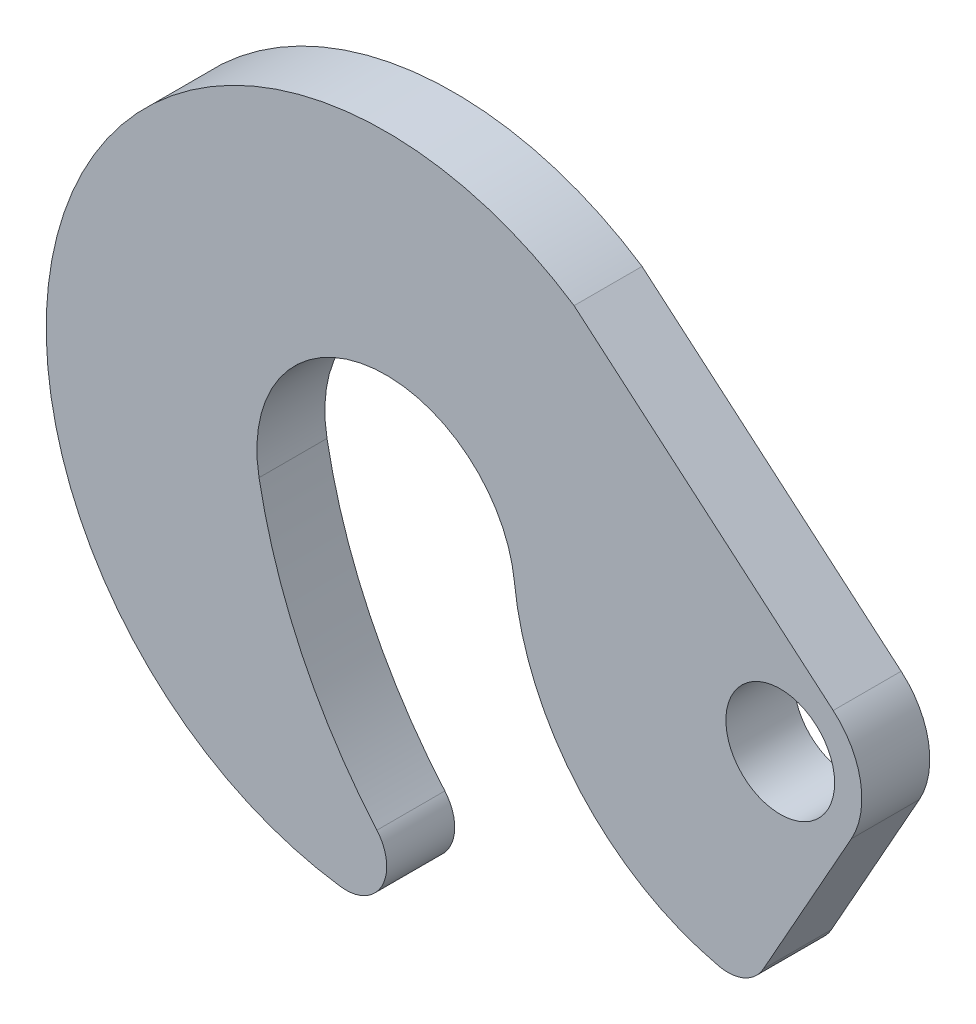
from build123d import *

# Parameters (mm, degrees)
ESQUISSE1_R        = 8
BOSS_EXTRU_1_DEPTH = 10


with BuildPart() as part:
    # Esquisse1 → Boss.-Extru.1 (new body)
    with BuildSketch(Plane.XY):
        with BuildLine():
            Line((27.663453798, 41.650129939), (65.787729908, 9.129691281))
            ThreePointArc((65.787729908, 9.129691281), (69.813529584, 2.107253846), (68.464034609, -5.874008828))
            Line((68.464034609, -5.874008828), (55.517571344, -28.937004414))
            ThreePointArc((55.517571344, -28.937004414), (52.714424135, -31.486400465), (48.942626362, -31.847781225))
            ThreePointArc((48.942626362, -31.847781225), (28.499828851, -19.721648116), (18.892439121, 2.018847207))
            ThreePointArc((18.892439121, 2.018847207), (-2.732528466, 18.802480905), (-18.685572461, -3.4422931))
            ThreePointArc((-18.685572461, -3.4422931), (-12.422314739, -22.717892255), (-1.346508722, -39.691508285))
            ThreePointArc((-1.346508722, -39.691508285), (-0.623535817, -46.466701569), (-6.700136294, -49.549048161))
            ThreePointArc((-6.700136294, -49.549048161), (-46.78875604, 17.629869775), (27.663453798, 41.650129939))
        make_face()
        with Locations((58, 0)):
            Circle(ESQUISSE1_R, mode=Mode.SUBTRACT)
    extrude(amount=BOSS_EXTRU_1_DEPTH)


solid = part.part
